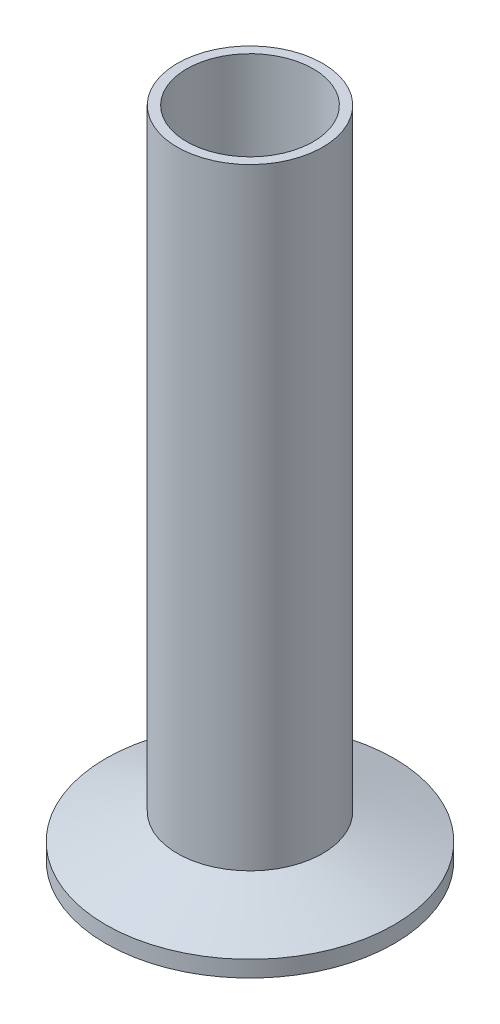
from build123d import *


with BuildPart() as part:
    # Sketch1 → Revolve2 (revolve)
    with BuildSketch(Plane.XY, mode=Mode.PRIVATE) as revolve2_sk:
        with BuildLine():
            Line((-11.049, 0), (-11.049, 114.3))
            Line((-11.049, 114.3), (-12.7, 114.3))
            Line((-12.7, 114.3), (-12.7, 7.393263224))
            Line((-12.7, 7.393263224), (-25.1968, 2.8448))
            Line((-25.1968, 2.8448), (-25.1968, 0))
            Line((-25.1968, 0), (-23.636608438, 0))
            ThreePointArc((-23.636608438, 0), (-23.204411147, 0.129217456), (-22.914066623, 0.474458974))
            ThreePointArc((-22.914066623, 0.474458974), (-21.8186, 1.1938), (-20.723133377, 0.474458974))
            ThreePointArc((-20.723133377, 0.474458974), (-20.432788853, 0.129217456), (-20.000591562, 0))
            Line((-20.000591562, 0), (-11.049, 0))
        make_face()
    revolve(revolve2_sk.sketch.rotate(Axis((0, 0, 0), (0, 1, 0)), 270), axis=Axis((0, 0, 0), (0, 1, 0)))


solid = part.part
